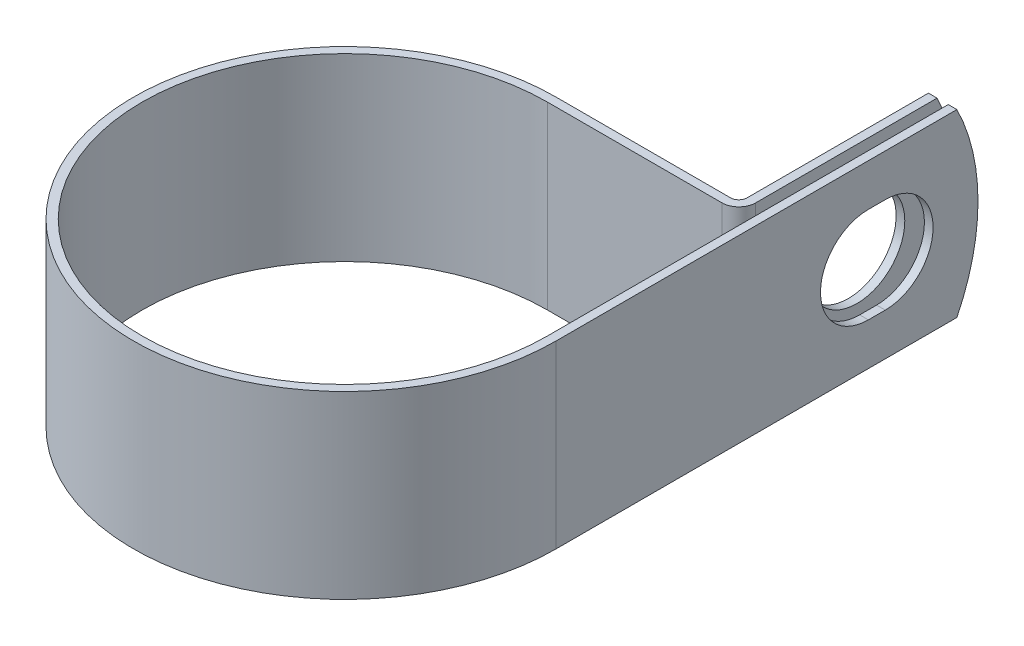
from build123d import *

# Parameters (mm, degrees)
EXTRUDE_THIN1_DEPTH = 12.7
SKETCH2_R           = 6.7437
CUT_EXTRUDE1_DEPTH  = 1.2192
CUT_EXTRUDE2_REACH  = 87.169
CUT_EXTRUDE3_DEPTH  = 83.411132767


with BuildPart() as part:
    # Sketch1 → Extrude-Thin1 (new, symmetric)
    with BuildSketch(Plane(origin=(0, 0, 0), x_dir=(1, 0, 0), z_dir=(0, 1, 0))):
        with BuildLine():
            Line((28.575, 59.5122), (28.575, 28.575))
            Line((28.575, 28.575), (28.575, 0))
            ThreePointArc((28.575, 0), (-20.205576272, -20.205576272), (0, 28.575))
            Line((0, 28.575), (24.62276, 28.575))
            ThreePointArc((24.62276, 28.575), (26.303863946, 29.271336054), (27.0002, 30.95244))
            Line((27.0002, 30.95244), (27.0002, 59.5122))
            Line((27.0002, 59.5122), (25.781, 59.5122))
            Line((25.781, 59.5122), (25.781, 30.95244))
            ThreePointArc((25.781, 30.95244), (25.441759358, 30.133440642), (24.62276, 29.7942))
            Line((24.62276, 29.7942), (0, 29.7942))
            ThreePointArc((0, 29.7942), (-21.06768086, -21.06768086), (29.7942, 0))
            Line((29.7942, 0), (29.7942, 28.575))
            Line((29.7942, 28.575), (29.7942, 59.5122))
            Line((29.7942, 59.5122), (28.575, 59.5122))
        make_face()
    extrude(amount=EXTRUDE_THIN1_DEPTH, both=True)

    # Sketch2 → Cut-Extrude1 (cut)
    with BuildSketch(Plane.ZY.offset(-25.781)):
        with Locations((-45.2374, 0)):
            Circle(SKETCH2_R)
    extrude(amount=-CUT_EXTRUDE1_DEPTH, mode=Mode.SUBTRACT)

    # Sketch3 → Cut-Extrude2 (cut, up to next)
    with BuildSketch(Plane(origin=(29.7942, 0, 0), x_dir=(0, 0, -1), z_dir=(1, 0, 0)), mode=Mode.PRIVATE) as cut_extrude2_sk1:
        with BuildLine():
            Line((44.0436, 6.7437), (46.4312, 6.7437))
            ThreePointArc((46.4312, 6.7437), (53.1749, 0), (46.4312, -6.7437))
            Line((46.4312, -6.7437), (44.0436, -6.7437))
            ThreePointArc((44.0436, -6.7437), (37.2999, 0), (44.0436, 6.7437))
        make_face()
    cut_extrude2_tool1 = extrude(cut_extrude2_sk1.sketch, amount=-CUT_EXTRUDE2_REACH, mode=Mode.PRIVATE) & part.part
    add(cut_extrude2_tool1.solids().sort_by_distance((29.7942, 0, -45.2374))[0], mode=Mode.SUBTRACT)

    # Sketch4 → Cut-Extrude3 (cut, through all)
    with BuildSketch(Plane.ZY.offset(-25.781)):
        with BuildLine():
            Line((-56.534868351, 12.7), (-59.5122, 12.7))
            Line((-59.5122, 12.7), (-59.5122, 0))
            ThreePointArc((-59.5122, 0), (-58.757911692, 6.522164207), (-56.534868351, 12.7))
        make_face()
        with BuildLine():
            ThreePointArc((-56.534868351, -12.7), (-58.757911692, -6.522164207), (-59.5122, 0))
            Line((-59.5122, 0), (-59.5122, -12.7))
            Line((-59.5122, -12.7), (-56.534868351, -12.7))
        make_face()
    extrude(amount=-CUT_EXTRUDE3_DEPTH, mode=Mode.SUBTRACT)


solid = part.part
